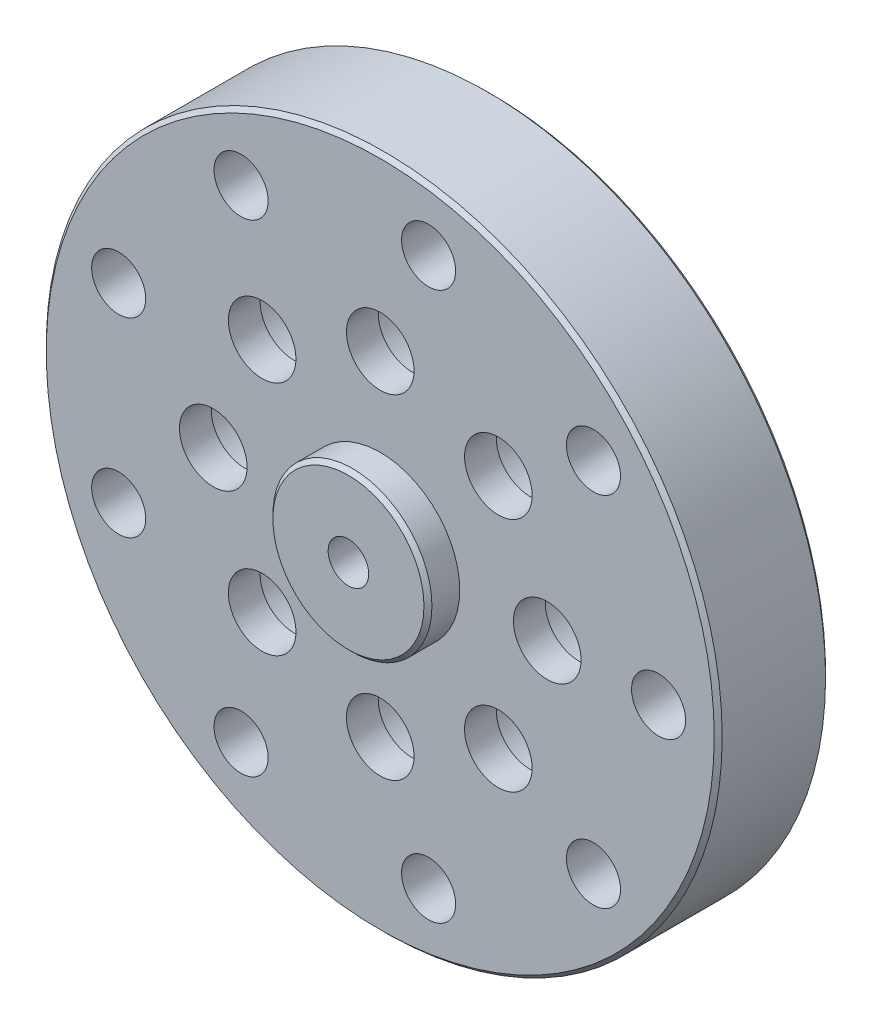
ISO-10303-21;
HEADER;
FILE_DESCRIPTION(('STEP AP214'),'2;1');
FILE_NAME('part.step','',(''),(''),'','','');
FILE_SCHEMA(('AUTOMOTIVE_DESIGN { 1 0 10303 214 1 1 1 1 }'));
ENDSEC;
DATA;
#1=APPLICATION_CONTEXT('core data for automotive mechanical design processes');
#2=APPLICATION_PROTOCOL_DEFINITION('international standard','automotive_design',2000,#1);
#3=PRODUCT_CONTEXT('',#1,'mechanical');
#4=PRODUCT('Part','Part','',(#3));
#5=PRODUCT_RELATED_PRODUCT_CATEGORY('part','',(#4));
#6=PRODUCT_DEFINITION_FORMATION('','',#4);
#7=PRODUCT_DEFINITION_CONTEXT('part definition',#1,'design');
#8=PRODUCT_DEFINITION('design','',#6,#7);
#9=PRODUCT_DEFINITION_SHAPE('','',#8);
#10=(LENGTH_UNIT() NAMED_UNIT(*) SI_UNIT(.MILLI.,.METRE.));
#11=(NAMED_UNIT(*) PLANE_ANGLE_UNIT() SI_UNIT($,.RADIAN.));
#12=(NAMED_UNIT(*) SI_UNIT($,.STERADIAN.) SOLID_ANGLE_UNIT());
#13=UNCERTAINTY_MEASURE_WITH_UNIT(LENGTH_MEASURE(1.E-05),#10,'distance_accuracy_value','');
#14=(GEOMETRIC_REPRESENTATION_CONTEXT(3) GLOBAL_UNCERTAINTY_ASSIGNED_CONTEXT((#13)) GLOBAL_UNIT_ASSIGNED_CONTEXT((#10,
#11,#12)) REPRESENTATION_CONTEXT('',''));
#15=CARTESIAN_POINT('',(0.,0.,0.));
#16=DIRECTION('',(0.,0.,1.));
#17=DIRECTION('',(1.,0.,0.));
#18=AXIS2_PLACEMENT_3D('',#15,#16,#17);
#19=CARTESIAN_POINT('',(0.,0.,14.));
#20=DIRECTION('',(0.,0.,1.));
#21=DIRECTION('',(1.,0.,0.));
#22=AXIS2_PLACEMENT_3D('',#19,#20,#21);
#23=PLANE('',#22);
#24=CARTESIAN_POINT('',(21.,0.,14.));
#25=DIRECTION('',(0.,0.,1.));
#26=DIRECTION('',(1.,0.,0.));
#27=AXIS2_PLACEMENT_3D('',#24,#25,#26);
#28=CIRCLE('',#27,4.25);
#29=CARTESIAN_POINT('',(25.25,0.,14.));
#30=VERTEX_POINT('',#29);
#31=EDGE_CURVE('E19',#30,#30,#28,.T.);
#32=ORIENTED_EDGE('',*,*,#31,.F.);
#33=EDGE_LOOP('',(#32));
#34=FACE_BOUND('',#33,.T.);
#35=CARTESIAN_POINT('',(14.8492424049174,14.8492424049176,14.));
#36=DIRECTION('',(0.,0.,1.));
#37=DIRECTION('',(1.,0.,0.));
#38=AXIS2_PLACEMENT_3D('',#35,#36,#37);
#39=CIRCLE('',#38,4.25);
#40=CARTESIAN_POINT('',(19.0992424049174,14.8492424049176,14.));
#41=VERTEX_POINT('',#40);
#42=EDGE_CURVE('E78',#41,#41,#39,.T.);
#43=ORIENTED_EDGE('',*,*,#42,.F.);
#44=EDGE_LOOP('',(#43));
#45=FACE_BOUND('',#44,.T.);
#46=CARTESIAN_POINT('',(14.8492424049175,-14.8492424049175,14.));
#47=DIRECTION('',(0.,0.,1.));
#48=DIRECTION('',(1.,0.,0.));
#49=AXIS2_PLACEMENT_3D('',#46,#47,#48);
#50=CIRCLE('',#49,4.25);
#51=CARTESIAN_POINT('',(19.0992424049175,-14.8492424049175,14.));
#52=VERTEX_POINT('',#51);
#53=EDGE_CURVE('E73',#52,#52,#50,.T.);
#54=ORIENTED_EDGE('',*,*,#53,.F.);
#55=EDGE_LOOP('',(#54));
#56=FACE_BOUND('',#55,.T.);
#57=CARTESIAN_POINT('',(0.,21.,14.));
#58=DIRECTION('',(0.,0.,1.));
#59=DIRECTION('',(1.,0.,0.));
#60=AXIS2_PLACEMENT_3D('',#57,#58,#59);
#61=CIRCLE('',#60,4.25);
#62=CARTESIAN_POINT('',(4.25,21.,14.));
#63=VERTEX_POINT('',#62);
#64=EDGE_CURVE('E67',#63,#63,#61,.T.);
#65=ORIENTED_EDGE('',*,*,#64,.F.);
#66=EDGE_LOOP('',(#65));
#67=FACE_BOUND('',#66,.T.);
#68=CARTESIAN_POINT('',(0.,-21.,14.));
#69=DIRECTION('',(0.,0.,1.));
#70=DIRECTION('',(1.,0.,0.));
#71=AXIS2_PLACEMENT_3D('',#68,#69,#70);
#72=CIRCLE('',#71,4.25);
#73=CARTESIAN_POINT('',(4.25,-21.,14.));
#74=VERTEX_POINT('',#73);
#75=EDGE_CURVE('E61',#74,#74,#72,.T.);
#76=ORIENTED_EDGE('',*,*,#75,.F.);
#77=EDGE_LOOP('',(#76));
#78=FACE_BOUND('',#77,.T.);
#79=CARTESIAN_POINT('',(-14.8492424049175,14.8492424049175,14.));
#80=DIRECTION('',(0.,0.,1.));
#81=DIRECTION('',(1.,0.,0.));
#82=AXIS2_PLACEMENT_3D('',#79,#80,#81);
#83=CIRCLE('',#82,4.25);
#84=CARTESIAN_POINT('',(-10.5992424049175,14.8492424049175,14.));
#85=VERTEX_POINT('',#84);
#86=EDGE_CURVE('E55',#85,#85,#83,.T.);
#87=ORIENTED_EDGE('',*,*,#86,.F.);
#88=EDGE_LOOP('',(#87));
#89=FACE_BOUND('',#88,.T.);
#90=CARTESIAN_POINT('',(-14.8492424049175,-14.8492424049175,14.));
#91=DIRECTION('',(0.,0.,1.));
#92=DIRECTION('',(1.,0.,0.));
#93=AXIS2_PLACEMENT_3D('',#90,#91,#92);
#94=CIRCLE('',#93,4.25);
#95=CARTESIAN_POINT('',(-10.5992424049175,-14.8492424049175,14.));
#96=VERTEX_POINT('',#95);
#97=EDGE_CURVE('E49',#96,#96,#94,.T.);
#98=ORIENTED_EDGE('',*,*,#97,.F.);
#99=EDGE_LOOP('',(#98));
#100=FACE_BOUND('',#99,.T.);
#101=CARTESIAN_POINT('',(-21.,0.,14.));
#102=DIRECTION('',(0.,0.,1.));
#103=DIRECTION('',(1.,0.,0.));
#104=AXIS2_PLACEMENT_3D('',#101,#102,#103);
#105=CIRCLE('',#104,4.25);
#106=CARTESIAN_POINT('',(-16.75,0.,14.));
#107=VERTEX_POINT('',#106);
#108=EDGE_CURVE('E44',#107,#107,#105,.T.);
#109=ORIENTED_EDGE('',*,*,#108,.F.);
#110=EDGE_LOOP('',(#109));
#111=FACE_BOUND('',#110,.T.);
#112=CARTESIAN_POINT('',(0.,0.,14.));
#113=DIRECTION('',(0.,0.,1.));
#114=DIRECTION('',(1.,0.,0.));
#115=AXIS2_PLACEMENT_3D('',#112,#113,#114);
#116=CIRCLE('',#115,42.);
#117=CARTESIAN_POINT('',(42.,0.,14.));
#118=VERTEX_POINT('',#117);
#119=EDGE_CURVE('E10',#118,#118,#116,.T.);
#120=ORIENTED_EDGE('',*,*,#119,.T.);
#121=EDGE_LOOP('',(#120));
#122=FACE_BOUND('',#121,.T.);
#123=CARTESIAN_POINT('',(34.9999999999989,0.,14.));
#124=DIRECTION('',(0.,0.,1.));
#125=DIRECTION('',(1.,0.,0.));
#126=AXIS2_PLACEMENT_3D('',#123,#124,#125);
#127=CIRCLE('',#126,3.4);
#128=CARTESIAN_POINT('',(38.3999999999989,0.,14.));
#129=VERTEX_POINT('',#128);
#130=EDGE_CURVE('E168',#129,#129,#127,.T.);
#131=ORIENTED_EDGE('',*,*,#130,.F.);
#132=EDGE_LOOP('',(#131));
#133=FACE_BOUND('',#132,.T.);
#134=CARTESIAN_POINT('',(26.8115555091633,22.4975663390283,14.));
#135=DIRECTION('',(0.,0.,1.));
#136=DIRECTION('',(1.,0.,0.));
#137=AXIS2_PLACEMENT_3D('',#134,#135,#136);
#138=CIRCLE('',#137,3.4);
#139=CARTESIAN_POINT('',(30.2115555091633,22.4975663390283,14.));
#140=VERTEX_POINT('',#139);
#141=EDGE_CURVE('E176',#140,#140,#138,.T.);
#142=ORIENTED_EDGE('',*,*,#141,.F.);
#143=EDGE_LOOP('',(#142));
#144=FACE_BOUND('',#143,.T.);
#145=CARTESIAN_POINT('',(26.8115555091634,-22.4975663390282,14.));
#146=DIRECTION('',(0.,0.,1.));
#147=DIRECTION('',(1.,0.,0.));
#148=AXIS2_PLACEMENT_3D('',#145,#146,#147);
#149=CIRCLE('',#148,3.4);
#150=CARTESIAN_POINT('',(30.2115555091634,-22.4975663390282,14.));
#151=VERTEX_POINT('',#150);
#152=EDGE_CURVE('E184',#151,#151,#149,.T.);
#153=ORIENTED_EDGE('',*,*,#152,.F.);
#154=EDGE_LOOP('',(#153));
#155=FACE_BOUND('',#154,.T.);
#156=CARTESIAN_POINT('',(6.07768621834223,34.4682713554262,14.));
#157=DIRECTION('',(0.,0.,1.));
#158=DIRECTION('',(1.,0.,0.));
#159=AXIS2_PLACEMENT_3D('',#156,#157,#158);
#160=CIRCLE('',#159,3.4);
#161=CARTESIAN_POINT('',(9.47768621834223,34.4682713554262,14.));
#162=VERTEX_POINT('',#161);
#163=EDGE_CURVE('E192',#162,#162,#160,.T.);
#164=ORIENTED_EDGE('',*,*,#163,.F.);
#165=EDGE_LOOP('',(#164));
#166=FACE_BOUND('',#165,.T.);
#167=CARTESIAN_POINT('',(6.07768621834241,-34.4682713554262,14.));
#168=DIRECTION('',(0.,0.,1.));
#169=DIRECTION('',(1.,0.,0.));
#170=AXIS2_PLACEMENT_3D('',#167,#168,#169);
#171=CIRCLE('',#170,3.4);
#172=CARTESIAN_POINT('',(9.47768621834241,-34.4682713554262,14.));
#173=VERTEX_POINT('',#172);
#174=EDGE_CURVE('E200',#173,#173,#171,.T.);
#175=ORIENTED_EDGE('',*,*,#174,.F.);
#176=EDGE_LOOP('',(#175));
#177=FACE_BOUND('',#176,.T.);
#178=CARTESIAN_POINT('',(-17.4999999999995,30.3108891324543,14.));
#179=DIRECTION('',(0.,0.,1.));
#180=DIRECTION('',(1.,0.,0.));
#181=AXIS2_PLACEMENT_3D('',#178,#179,#180);
#182=CIRCLE('',#181,3.4);
#183=CARTESIAN_POINT('',(-14.0999999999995,30.3108891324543,14.));
#184=VERTEX_POINT('',#183);
#185=EDGE_CURVE('E208',#184,#184,#182,.T.);
#186=ORIENTED_EDGE('',*,*,#185,.F.);
#187=EDGE_LOOP('',(#186));
#188=FACE_BOUND('',#187,.T.);
#189=CARTESIAN_POINT('',(-17.4999999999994,-30.3108891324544,14.));
#190=DIRECTION('',(0.,0.,1.));
#191=DIRECTION('',(1.,0.,0.));
#192=AXIS2_PLACEMENT_3D('',#189,#190,#191);
#193=CIRCLE('',#192,3.4);
#194=CARTESIAN_POINT('',(-14.0999999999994,-30.3108891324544,14.));
#195=VERTEX_POINT('',#194);
#196=EDGE_CURVE('E216',#195,#195,#193,.T.);
#197=ORIENTED_EDGE('',*,*,#196,.F.);
#198=EDGE_LOOP('',(#197));
#199=FACE_BOUND('',#198,.T.);
#200=CARTESIAN_POINT('',(-32.8892417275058,11.9707050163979,14.));
#201=DIRECTION('',(0.,0.,1.));
#202=DIRECTION('',(1.,0.,0.));
#203=AXIS2_PLACEMENT_3D('',#200,#201,#202);
#204=CIRCLE('',#203,3.4);
#205=CARTESIAN_POINT('',(-29.4892417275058,11.9707050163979,14.));
#206=VERTEX_POINT('',#205);
#207=EDGE_CURVE('E224',#206,#206,#204,.T.);
#208=ORIENTED_EDGE('',*,*,#207,.F.);
#209=EDGE_LOOP('',(#208));
#210=FACE_BOUND('',#209,.T.);
#211=CARTESIAN_POINT('',(-32.8892417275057,-11.9707050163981,14.));
#212=DIRECTION('',(0.,0.,1.));
#213=DIRECTION('',(1.,0.,0.));
#214=AXIS2_PLACEMENT_3D('',#211,#212,#213);
#215=CIRCLE('',#214,3.4);
#216=CARTESIAN_POINT('',(-29.4892417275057,-11.9707050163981,14.));
#217=VERTEX_POINT('',#216);
#218=EDGE_CURVE('E232',#217,#217,#215,.T.);
#219=ORIENTED_EDGE('',*,*,#218,.F.);
#220=EDGE_LOOP('',(#219));
#221=FACE_BOUND('',#220,.T.);
#222=CARTESIAN_POINT('',(0.,0.,14.));
#223=DIRECTION('',(0.,0.,1.));
#224=DIRECTION('',(1.,0.,0.));
#225=AXIS2_PLACEMENT_3D('',#222,#223,#224);
#226=CIRCLE('',#225,10.);
#227=CARTESIAN_POINT('',(10.,0.,14.));
#228=VERTEX_POINT('',#227);
#229=EDGE_CURVE('E237',#228,#228,#226,.T.);
#230=ORIENTED_EDGE('',*,*,#229,.F.);
#231=EDGE_LOOP('',(#230));
#232=FACE_BOUND('',#231,.T.);
#233=ADVANCED_FACE('F15',(#34,#45,#56,#67,#78,#89,#100,#111,#122,#133,#144,#155,#166,#177,#188,
#199,#210,#221,#232),#23,.T.);
#234=CARTESIAN_POINT('',(0.,0.,0.));
#235=DIRECTION('',(0.,0.,-1.));
#236=DIRECTION('',(-1.,0.,0.));
#237=AXIS2_PLACEMENT_3D('',#234,#235,#236);
#238=PLANE('',#237);
#239=CARTESIAN_POINT('',(21.,0.,0.));
#240=DIRECTION('',(0.,0.,1.));
#241=DIRECTION('',(1.,0.,0.));
#242=AXIS2_PLACEMENT_3D('',#239,#240,#241);
#243=CIRCLE('',#242,7.);
#244=CARTESIAN_POINT('',(28.,0.,0.));
#245=VERTEX_POINT('',#244);
#246=EDGE_CURVE('E1032',#245,#245,#243,.T.);
#247=ORIENTED_EDGE('',*,*,#246,.T.);
#248=EDGE_LOOP('',(#247));
#249=FACE_BOUND('',#248,.T.);
#250=CARTESIAN_POINT('',(14.8492424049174,14.8492424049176,0.));
#251=DIRECTION('',(0.,0.,1.));
#252=DIRECTION('',(1.,0.,0.));
#253=AXIS2_PLACEMENT_3D('',#250,#251,#252);
#254=CIRCLE('',#253,7.);
#255=CARTESIAN_POINT('',(21.8492424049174,14.8492424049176,0.));
#256=VERTEX_POINT('',#255);
#257=EDGE_CURVE('E102',#256,#256,#254,.T.);
#258=ORIENTED_EDGE('',*,*,#257,.T.);
#259=EDGE_LOOP('',(#258));
#260=FACE_BOUND('',#259,.T.);
#261=CARTESIAN_POINT('',(14.8492424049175,-14.8492424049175,0.));
#262=DIRECTION('',(0.,0.,1.));
#263=DIRECTION('',(1.,0.,0.));
#264=AXIS2_PLACEMENT_3D('',#261,#262,#263);
#265=CIRCLE('',#264,7.);
#266=CARTESIAN_POINT('',(21.8492424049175,-14.8492424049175,0.));
#267=VERTEX_POINT('',#266);
#268=EDGE_CURVE('E81',#267,#267,#265,.T.);
#269=ORIENTED_EDGE('',*,*,#268,.T.);
#270=EDGE_LOOP('',(#269));
#271=FACE_BOUND('',#270,.T.);
#272=CARTESIAN_POINT('',(0.,21.,0.));
#273=DIRECTION('',(0.,0.,1.));
#274=DIRECTION('',(1.,0.,0.));
#275=AXIS2_PLACEMENT_3D('',#272,#273,#274);
#276=CIRCLE('',#275,7.);
#277=CARTESIAN_POINT('',(7.,21.,0.));
#278=VERTEX_POINT('',#277);
#279=EDGE_CURVE('E76',#278,#278,#276,.T.);
#280=ORIENTED_EDGE('',*,*,#279,.T.);
#281=EDGE_LOOP('',(#280));
#282=FACE_BOUND('',#281,.T.);
#283=CARTESIAN_POINT('',(0.,-21.,0.));
#284=DIRECTION('',(0.,0.,1.));
#285=DIRECTION('',(1.,0.,0.));
#286=AXIS2_PLACEMENT_3D('',#283,#284,#285);
#287=CIRCLE('',#286,7.);
#288=CARTESIAN_POINT('',(7.,-21.,0.));
#289=VERTEX_POINT('',#288);
#290=EDGE_CURVE('E71',#289,#289,#287,.T.);
#291=ORIENTED_EDGE('',*,*,#290,.T.);
#292=EDGE_LOOP('',(#291));
#293=FACE_BOUND('',#292,.T.);
#294=CARTESIAN_POINT('',(-14.8492424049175,14.8492424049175,0.));
#295=DIRECTION('',(0.,0.,1.));
#296=DIRECTION('',(1.,0.,0.));
#297=AXIS2_PLACEMENT_3D('',#294,#295,#296);
#298=CIRCLE('',#297,7.);
#299=CARTESIAN_POINT('',(-7.8492424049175,14.8492424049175,0.));
#300=VERTEX_POINT('',#299);
#301=EDGE_CURVE('E65',#300,#300,#298,.T.);
#302=ORIENTED_EDGE('',*,*,#301,.T.);
#303=EDGE_LOOP('',(#302));
#304=FACE_BOUND('',#303,.T.);
#305=CARTESIAN_POINT('',(-14.8492424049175,-14.8492424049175,0.));
#306=DIRECTION('',(0.,0.,1.));
#307=DIRECTION('',(1.,0.,0.));
#308=AXIS2_PLACEMENT_3D('',#305,#306,#307);
#309=CIRCLE('',#308,7.);
#310=CARTESIAN_POINT('',(-7.8492424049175,-14.8492424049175,0.));
#311=VERTEX_POINT('',#310);
#312=EDGE_CURVE('E59',#311,#311,#309,.T.);
#313=ORIENTED_EDGE('',*,*,#312,.T.);
#314=EDGE_LOOP('',(#313));
#315=FACE_BOUND('',#314,.T.);
#316=CARTESIAN_POINT('',(-21.,0.,0.));
#317=DIRECTION('',(0.,0.,1.));
#318=DIRECTION('',(1.,0.,0.));
#319=AXIS2_PLACEMENT_3D('',#316,#317,#318);
#320=CIRCLE('',#319,7.);
#321=CARTESIAN_POINT('',(-14.,0.,0.));
#322=VERTEX_POINT('',#321);
#323=EDGE_CURVE('E53',#322,#322,#320,.T.);
#324=ORIENTED_EDGE('',*,*,#323,.T.);
#325=EDGE_LOOP('',(#324));
#326=FACE_BOUND('',#325,.T.);
#327=CARTESIAN_POINT('',(0.,0.,0.));
#328=DIRECTION('',(0.,0.,-1.));
#329=DIRECTION('',(-1.,0.,0.));
#330=AXIS2_PLACEMENT_3D('',#327,#328,#329);
#331=CIRCLE('',#330,10.5);
#332=CARTESIAN_POINT('',(-10.5,0.,0.));
#333=VERTEX_POINT('',#332);
#334=EDGE_CURVE('E255',#333,#333,#331,.F.);
#335=ORIENTED_EDGE('',*,*,#334,.T.);
#336=EDGE_LOOP('',(#335));
#337=FACE_BOUND('',#336,.T.);
#338=CARTESIAN_POINT('',(0.,0.,0.));
#339=DIRECTION('',(0.,0.,-1.));
#340=DIRECTION('',(-1.,0.,0.));
#341=AXIS2_PLACEMENT_3D('',#338,#339,#340);
#342=CIRCLE('',#341,42.);
#343=CARTESIAN_POINT('',(-42.,0.,0.));
#344=VERTEX_POINT('',#343);
#345=EDGE_CURVE('E251',#344,#344,#342,.T.);
#346=ORIENTED_EDGE('',*,*,#345,.T.);
#347=EDGE_LOOP('',(#346));
#348=FACE_BOUND('',#347,.T.);
#349=CARTESIAN_POINT('',(34.9999999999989,0.,0.));
#350=DIRECTION('',(0.,0.,1.));
#351=DIRECTION('',(1.,0.,0.));
#352=AXIS2_PLACEMENT_3D('',#349,#350,#351);
#353=CIRCLE('',#352,3.4);
#354=CARTESIAN_POINT('',(38.3999999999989,0.,0.));
#355=VERTEX_POINT('',#354);
#356=EDGE_CURVE('E42',#355,#355,#353,.T.);
#357=ORIENTED_EDGE('',*,*,#356,.T.);
#358=EDGE_LOOP('',(#357));
#359=FACE_BOUND('',#358,.T.);
#360=CARTESIAN_POINT('',(26.8115555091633,22.4975663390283,0.));
#361=DIRECTION('',(0.,0.,1.));
#362=DIRECTION('',(1.,0.,0.));
#363=AXIS2_PLACEMENT_3D('',#360,#361,#362);
#364=CIRCLE('',#363,3.4);
#365=CARTESIAN_POINT('',(30.2115555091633,22.4975663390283,0.));
#366=VERTEX_POINT('',#365);
#367=EDGE_CURVE('E172',#366,#366,#364,.T.);
#368=ORIENTED_EDGE('',*,*,#367,.T.);
#369=EDGE_LOOP('',(#368));
#370=FACE_BOUND('',#369,.T.);
#371=CARTESIAN_POINT('',(26.8115555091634,-22.4975663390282,0.));
#372=DIRECTION('',(0.,0.,1.));
#373=DIRECTION('',(1.,0.,0.));
#374=AXIS2_PLACEMENT_3D('',#371,#372,#373);
#375=CIRCLE('',#374,3.4);
#376=CARTESIAN_POINT('',(30.2115555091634,-22.4975663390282,0.));
#377=VERTEX_POINT('',#376);
#378=EDGE_CURVE('E180',#377,#377,#375,.T.);
#379=ORIENTED_EDGE('',*,*,#378,.T.);
#380=EDGE_LOOP('',(#379));
#381=FACE_BOUND('',#380,.T.);
#382=CARTESIAN_POINT('',(6.07768621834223,34.4682713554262,0.));
#383=DIRECTION('',(0.,0.,1.));
#384=DIRECTION('',(1.,0.,0.));
#385=AXIS2_PLACEMENT_3D('',#382,#383,#384);
#386=CIRCLE('',#385,3.4);
#387=CARTESIAN_POINT('',(9.47768621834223,34.4682713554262,0.));
#388=VERTEX_POINT('',#387);
#389=EDGE_CURVE('E188',#388,#388,#386,.T.);
#390=ORIENTED_EDGE('',*,*,#389,.T.);
#391=EDGE_LOOP('',(#390));
#392=FACE_BOUND('',#391,.T.);
#393=CARTESIAN_POINT('',(6.07768621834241,-34.4682713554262,0.));
#394=DIRECTION('',(0.,0.,1.));
#395=DIRECTION('',(1.,0.,0.));
#396=AXIS2_PLACEMENT_3D('',#393,#394,#395);
#397=CIRCLE('',#396,3.4);
#398=CARTESIAN_POINT('',(9.47768621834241,-34.4682713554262,0.));
#399=VERTEX_POINT('',#398);
#400=EDGE_CURVE('E196',#399,#399,#397,.T.);
#401=ORIENTED_EDGE('',*,*,#400,.T.);
#402=EDGE_LOOP('',(#401));
#403=FACE_BOUND('',#402,.T.);
#404=CARTESIAN_POINT('',(-17.4999999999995,30.3108891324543,0.));
#405=DIRECTION('',(0.,0.,1.));
#406=DIRECTION('',(1.,0.,0.));
#407=AXIS2_PLACEMENT_3D('',#404,#405,#406);
#408=CIRCLE('',#407,3.4);
#409=CARTESIAN_POINT('',(-14.0999999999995,30.3108891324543,0.));
#410=VERTEX_POINT('',#409);
#411=EDGE_CURVE('E204',#410,#410,#408,.T.);
#412=ORIENTED_EDGE('',*,*,#411,.T.);
#413=EDGE_LOOP('',(#412));
#414=FACE_BOUND('',#413,.T.);
#415=CARTESIAN_POINT('',(-17.4999999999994,-30.3108891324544,0.));
#416=DIRECTION('',(0.,0.,1.));
#417=DIRECTION('',(1.,0.,0.));
#418=AXIS2_PLACEMENT_3D('',#415,#416,#417);
#419=CIRCLE('',#418,3.4);
#420=CARTESIAN_POINT('',(-14.0999999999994,-30.3108891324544,0.));
#421=VERTEX_POINT('',#420);
#422=EDGE_CURVE('E212',#421,#421,#419,.T.);
#423=ORIENTED_EDGE('',*,*,#422,.T.);
#424=EDGE_LOOP('',(#423));
#425=FACE_BOUND('',#424,.T.);
#426=CARTESIAN_POINT('',(-32.8892417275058,11.9707050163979,0.));
#427=DIRECTION('',(0.,0.,1.));
#428=DIRECTION('',(1.,0.,0.));
#429=AXIS2_PLACEMENT_3D('',#426,#427,#428);
#430=CIRCLE('',#429,3.4);
#431=CARTESIAN_POINT('',(-29.4892417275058,11.9707050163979,0.));
#432=VERTEX_POINT('',#431);
#433=EDGE_CURVE('E220',#432,#432,#430,.T.);
#434=ORIENTED_EDGE('',*,*,#433,.T.);
#435=EDGE_LOOP('',(#434));
#436=FACE_BOUND('',#435,.T.);
#437=CARTESIAN_POINT('',(-32.8892417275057,-11.9707050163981,0.));
#438=DIRECTION('',(0.,0.,1.));
#439=DIRECTION('',(1.,0.,0.));
#440=AXIS2_PLACEMENT_3D('',#437,#438,#439);
#441=CIRCLE('',#440,3.4);
#442=CARTESIAN_POINT('',(-29.4892417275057,-11.9707050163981,0.));
#443=VERTEX_POINT('',#442);
#444=EDGE_CURVE('E228',#443,#443,#441,.T.);
#445=ORIENTED_EDGE('',*,*,#444,.T.);
#446=EDGE_LOOP('',(#445));
#447=FACE_BOUND('',#446,.T.);
#448=ADVANCED_FACE('F285',(#249,#260,#271,#282,#293,#304,#315,#326,#337,#348,#359,#370,#381,
#392,#403,#414,#425,#436,#447),#238,.T.);
#449=CARTESIAN_POINT('',(0.,0.,0.));
#450=DIRECTION('',(0.,0.,1.));
#451=DIRECTION('',(1.,0.,0.));
#452=AXIS2_PLACEMENT_3D('',#449,#450,#451);
#453=CYLINDRICAL_SURFACE('',#452,42.5);
#454=CARTESIAN_POINT('',(0.,0.,13.5));
#455=DIRECTION('',(0.,0.,1.));
#456=DIRECTION('',(1.,0.,0.));
#457=AXIS2_PLACEMENT_3D('',#454,#455,#456);
#458=CIRCLE('',#457,42.5);
#459=CARTESIAN_POINT('',(42.5,0.,13.5));
#460=VERTEX_POINT('',#459);
#461=EDGE_CURVE('E24',#460,#460,#458,.F.);
#462=ORIENTED_EDGE('',*,*,#461,.T.);
#463=EDGE_LOOP('',(#462));
#464=FACE_BOUND('',#463,.T.);
#465=CARTESIAN_POINT('',(0.,0.,0.5));
#466=DIRECTION('',(0.,0.,-1.));
#467=DIRECTION('',(-1.,0.,0.));
#468=AXIS2_PLACEMENT_3D('',#465,#466,#467);
#469=CIRCLE('',#468,42.5);
#470=CARTESIAN_POINT('',(-42.5,0.,0.5));
#471=VERTEX_POINT('',#470);
#472=EDGE_CURVE('E34',#471,#471,#469,.F.);
#473=ORIENTED_EDGE('',*,*,#472,.T.);
#474=EDGE_LOOP('',(#473));
#475=FACE_BOUND('',#474,.T.);
#476=ADVANCED_FACE('F267',(#464,#475),#453,.T.);
#477=CARTESIAN_POINT('',(0.,0.,4.));
#478=DIRECTION('',(0.,0.,1.));
#479=DIRECTION('',(1.,0.,0.));
#480=AXIS2_PLACEMENT_3D('',#477,#478,#479);
#481=PLANE('',#480);
#482=CARTESIAN_POINT('',(0.,0.,4.));
#483=DIRECTION('',(0.,0.,1.));
#484=DIRECTION('',(1.,0.,0.));
#485=AXIS2_PLACEMENT_3D('',#482,#483,#484);
#486=CIRCLE('',#485,2.55);
#487=CARTESIAN_POINT('',(2.55,0.,4.));
#488=VERTEX_POINT('',#487);
#489=EDGE_CURVE('E43',#488,#488,#486,.T.);
#490=ORIENTED_EDGE('',*,*,#489,.T.);
#491=EDGE_LOOP('',(#490));
#492=FACE_BOUND('',#491,.T.);
#493=CARTESIAN_POINT('',(0.,0.,4.));
#494=DIRECTION('',(0.,0.,-1.));
#495=DIRECTION('',(1.,0.,0.));
#496=AXIS2_PLACEMENT_3D('',#493,#494,#495);
#497=CIRCLE('',#496,10.);
#498=CARTESIAN_POINT('',(10.,0.,4.));
#499=VERTEX_POINT('',#498);
#500=EDGE_CURVE('E236',#499,#499,#497,.F.);
#501=ORIENTED_EDGE('',*,*,#500,.F.);
#502=EDGE_LOOP('',(#501));
#503=FACE_BOUND('',#502,.T.);
#504=ADVANCED_FACE('F299',(#492,#503),#481,.F.);
#505=CARTESIAN_POINT('',(0.,0.,0.));
#506=DIRECTION('',(0.,0.,1.));
#507=DIRECTION('',(1.,0.,0.));
#508=AXIS2_PLACEMENT_3D('',#505,#506,#507);
#509=CYLINDRICAL_SURFACE('',#508,10.);
#510=CARTESIAN_POINT('',(0.,0.,0.5));
#511=DIRECTION('',(0.,0.,-1.));
#512=DIRECTION('',(-1.,0.,0.));
#513=AXIS2_PLACEMENT_3D('',#510,#511,#512);
#514=CIRCLE('',#513,10.);
#515=CARTESIAN_POINT('',(-10.,0.,0.5));
#516=VERTEX_POINT('',#515);
#517=EDGE_CURVE('E258',#516,#516,#514,.T.);
#518=ORIENTED_EDGE('',*,*,#517,.T.);
#519=EDGE_LOOP('',(#518));
#520=FACE_BOUND('',#519,.T.);
#521=ORIENTED_EDGE('',*,*,#500,.T.);
#522=EDGE_LOOP('',(#521));
#523=FACE_BOUND('',#522,.T.);
#524=ADVANCED_FACE('F353',(#520,#523),#509,.F.);
#525=CARTESIAN_POINT('',(0.,0.,18.));
#526=DIRECTION('',(0.,0.,1.));
#527=DIRECTION('',(1.,0.,0.));
#528=AXIS2_PLACEMENT_3D('',#525,#526,#527);
#529=PLANE('',#528);
#530=CARTESIAN_POINT('',(0.,0.,18.));
#531=DIRECTION('',(0.,0.,1.));
#532=DIRECTION('',(1.,0.,0.));
#533=AXIS2_PLACEMENT_3D('',#530,#531,#532);
#534=CIRCLE('',#533,2.55);
#535=CARTESIAN_POINT('',(2.55,0.,18.));
#536=VERTEX_POINT('',#535);
#537=EDGE_CURVE('E38',#536,#536,#534,.T.);
#538=ORIENTED_EDGE('',*,*,#537,.F.);
#539=EDGE_LOOP('',(#538));
#540=FACE_BOUND('',#539,.T.);
#541=CARTESIAN_POINT('',(0.,0.,18.));
#542=DIRECTION('',(0.,0.,1.));
#543=DIRECTION('',(1.,0.,0.));
#544=AXIS2_PLACEMENT_3D('',#541,#542,#543);
#545=CIRCLE('',#544,9.5);
#546=CARTESIAN_POINT('',(9.5,0.,18.));
#547=VERTEX_POINT('',#546);
#548=EDGE_CURVE('E248',#547,#547,#545,.T.);
#549=ORIENTED_EDGE('',*,*,#548,.T.);
#550=EDGE_LOOP('',(#549));
#551=FACE_BOUND('',#550,.T.);
#552=ADVANCED_FACE('F347',(#540,#551),#529,.T.);
#553=CARTESIAN_POINT('',(0.,0.,14.));
#554=DIRECTION('',(0.,0.,1.));
#555=DIRECTION('',(1.,0.,0.));
#556=AXIS2_PLACEMENT_3D('',#553,#554,#555);
#557=CYLINDRICAL_SURFACE('',#556,10.);
#558=CARTESIAN_POINT('',(0.,0.,17.5));
#559=DIRECTION('',(0.,0.,1.));
#560=DIRECTION('',(1.,0.,0.));
#561=AXIS2_PLACEMENT_3D('',#558,#559,#560);
#562=CIRCLE('',#561,10.);
#563=CARTESIAN_POINT('',(10.,0.,17.5));
#564=VERTEX_POINT('',#563);
#565=EDGE_CURVE('E241',#564,#564,#562,.F.);
#566=ORIENTED_EDGE('',*,*,#565,.T.);
#567=EDGE_LOOP('',(#566));
#568=FACE_BOUND('',#567,.T.);
#569=ORIENTED_EDGE('',*,*,#229,.T.);
#570=EDGE_LOOP('',(#569));
#571=FACE_BOUND('',#570,.T.);
#572=ADVANCED_FACE('F337',(#568,#571),#557,.T.);
#573=CARTESIAN_POINT('',(-32.8892417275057,-11.9707050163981,0.));
#574=DIRECTION('',(0.,0.,1.));
#575=DIRECTION('',(1.,0.,0.));
#576=AXIS2_PLACEMENT_3D('',#573,#574,#575);
#577=CYLINDRICAL_SURFACE('',#576,3.4);
#578=ORIENTED_EDGE('',*,*,#218,.T.);
#579=EDGE_LOOP('',(#578));
#580=FACE_BOUND('',#579,.T.);
#581=ORIENTED_EDGE('',*,*,#444,.F.);
#582=EDGE_LOOP('',(#581));
#583=FACE_BOUND('',#582,.T.);
#584=ADVANCED_FACE('F334',(#580,#583),#577,.F.);
#585=CARTESIAN_POINT('',(-32.8892417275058,11.9707050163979,0.));
#586=DIRECTION('',(0.,0.,1.));
#587=DIRECTION('',(1.,0.,0.));
#588=AXIS2_PLACEMENT_3D('',#585,#586,#587);
#589=CYLINDRICAL_SURFACE('',#588,3.4);
#590=ORIENTED_EDGE('',*,*,#207,.T.);
#591=EDGE_LOOP('',(#590));
#592=FACE_BOUND('',#591,.T.);
#593=ORIENTED_EDGE('',*,*,#433,.F.);
#594=EDGE_LOOP('',(#593));
#595=FACE_BOUND('',#594,.T.);
#596=ADVANCED_FACE('F336',(#592,#595),#589,.F.);
#597=CARTESIAN_POINT('',(-17.4999999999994,-30.3108891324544,0.));
#598=DIRECTION('',(0.,0.,1.));
#599=DIRECTION('',(1.,0.,0.));
#600=AXIS2_PLACEMENT_3D('',#597,#598,#599);
#601=CYLINDRICAL_SURFACE('',#600,3.4);
#602=ORIENTED_EDGE('',*,*,#196,.T.);
#603=EDGE_LOOP('',(#602));
#604=FACE_BOUND('',#603,.T.);
#605=ORIENTED_EDGE('',*,*,#422,.F.);
#606=EDGE_LOOP('',(#605));
#607=FACE_BOUND('',#606,.T.);
#608=ADVANCED_FACE('F344',(#604,#607),#601,.F.);
#609=CARTESIAN_POINT('',(-17.4999999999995,30.3108891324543,0.));
#610=DIRECTION('',(0.,0.,1.));
#611=DIRECTION('',(1.,0.,0.));
#612=AXIS2_PLACEMENT_3D('',#609,#610,#611);
#613=CYLINDRICAL_SURFACE('',#612,3.4);
#614=ORIENTED_EDGE('',*,*,#185,.T.);
#615=EDGE_LOOP('',(#614));
#616=FACE_BOUND('',#615,.T.);
#617=ORIENTED_EDGE('',*,*,#411,.F.);
#618=EDGE_LOOP('',(#617));
#619=FACE_BOUND('',#618,.T.);
#620=ADVANCED_FACE('F402',(#616,#619),#613,.F.);
#621=CARTESIAN_POINT('',(6.07768621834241,-34.4682713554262,0.));
#622=DIRECTION('',(0.,0.,1.));
#623=DIRECTION('',(1.,0.,0.));
#624=AXIS2_PLACEMENT_3D('',#621,#622,#623);
#625=CYLINDRICAL_SURFACE('',#624,3.4);
#626=ORIENTED_EDGE('',*,*,#174,.T.);
#627=EDGE_LOOP('',(#626));
#628=FACE_BOUND('',#627,.T.);
#629=ORIENTED_EDGE('',*,*,#400,.F.);
#630=EDGE_LOOP('',(#629));
#631=FACE_BOUND('',#630,.T.);
#632=ADVANCED_FACE('F412',(#628,#631),#625,.F.);
#633=CARTESIAN_POINT('',(6.07768621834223,34.4682713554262,0.));
#634=DIRECTION('',(0.,0.,1.));
#635=DIRECTION('',(1.,0.,0.));
#636=AXIS2_PLACEMENT_3D('',#633,#634,#635);
#637=CYLINDRICAL_SURFACE('',#636,3.4);
#638=ORIENTED_EDGE('',*,*,#163,.T.);
#639=EDGE_LOOP('',(#638));
#640=FACE_BOUND('',#639,.T.);
#641=ORIENTED_EDGE('',*,*,#389,.F.);
#642=EDGE_LOOP('',(#641));
#643=FACE_BOUND('',#642,.T.);
#644=ADVANCED_FACE('F423',(#640,#643),#637,.F.);
#645=CARTESIAN_POINT('',(26.8115555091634,-22.4975663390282,0.));
#646=DIRECTION('',(0.,0.,1.));
#647=DIRECTION('',(1.,0.,0.));
#648=AXIS2_PLACEMENT_3D('',#645,#646,#647);
#649=CYLINDRICAL_SURFACE('',#648,3.4);
#650=ORIENTED_EDGE('',*,*,#152,.T.);
#651=EDGE_LOOP('',(#650));
#652=FACE_BOUND('',#651,.T.);
#653=ORIENTED_EDGE('',*,*,#378,.F.);
#654=EDGE_LOOP('',(#653));
#655=FACE_BOUND('',#654,.T.);
#656=ADVANCED_FACE('F434',(#652,#655),#649,.F.);
#657=CARTESIAN_POINT('',(26.8115555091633,22.4975663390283,0.));
#658=DIRECTION('',(0.,0.,1.));
#659=DIRECTION('',(1.,0.,0.));
#660=AXIS2_PLACEMENT_3D('',#657,#658,#659);
#661=CYLINDRICAL_SURFACE('',#660,3.4);
#662=ORIENTED_EDGE('',*,*,#141,.T.);
#663=EDGE_LOOP('',(#662));
#664=FACE_BOUND('',#663,.T.);
#665=ORIENTED_EDGE('',*,*,#367,.F.);
#666=EDGE_LOOP('',(#665));
#667=FACE_BOUND('',#666,.T.);
#668=ADVANCED_FACE('F445',(#664,#667),#661,.F.);
#669=CARTESIAN_POINT('',(34.9999999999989,0.,0.));
#670=DIRECTION('',(0.,0.,1.));
#671=DIRECTION('',(1.,0.,0.));
#672=AXIS2_PLACEMENT_3D('',#669,#670,#671);
#673=CYLINDRICAL_SURFACE('',#672,3.4);
#674=ORIENTED_EDGE('',*,*,#130,.T.);
#675=EDGE_LOOP('',(#674));
#676=FACE_BOUND('',#675,.T.);
#677=ORIENTED_EDGE('',*,*,#356,.F.);
#678=EDGE_LOOP('',(#677));
#679=FACE_BOUND('',#678,.T.);
#680=ADVANCED_FACE('F304',(#676,#679),#673,.F.);
#681=CARTESIAN_POINT('',(0.,0.,17.5));
#682=DIRECTION('',(0.,0.,-1.));
#683=DIRECTION('',(-1.,0.,0.));
#684=AXIS2_PLACEMENT_3D('',#681,#682,#683);
#685=CONICAL_SURFACE('',#684,10.,0.785398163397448);
#686=ORIENTED_EDGE('',*,*,#548,.F.);
#687=EDGE_LOOP('',(#686));
#688=FACE_BOUND('',#687,.T.);
#689=ORIENTED_EDGE('',*,*,#565,.F.);
#690=EDGE_LOOP('',(#689));
#691=FACE_BOUND('',#690,.T.);
#692=ADVANCED_FACE('F301',(#688,#691),#685,.T.);
#693=CARTESIAN_POINT('',(0.,0.,0.));
#694=DIRECTION('',(0.,0.,-1.));
#695=DIRECTION('',(-1.,0.,0.));
#696=AXIS2_PLACEMENT_3D('',#693,#694,#695);
#697=CONICAL_SURFACE('',#696,10.5,0.785398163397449);
#698=ORIENTED_EDGE('',*,*,#517,.F.);
#699=EDGE_LOOP('',(#698));
#700=FACE_BOUND('',#699,.T.);
#701=ORIENTED_EDGE('',*,*,#334,.F.);
#702=EDGE_LOOP('',(#701));
#703=FACE_BOUND('',#702,.T.);
#704=ADVANCED_FACE('F281',(#700,#703),#697,.F.);
#705=CARTESIAN_POINT('',(0.,0.,13.5));
#706=DIRECTION('',(0.,0.,-1.));
#707=DIRECTION('',(-1.,0.,0.));
#708=AXIS2_PLACEMENT_3D('',#705,#706,#707);
#709=CONICAL_SURFACE('',#708,42.5,0.785398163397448);
#710=ORIENTED_EDGE('',*,*,#119,.F.);
#711=EDGE_LOOP('',(#710));
#712=FACE_BOUND('',#711,.T.);
#713=ORIENTED_EDGE('',*,*,#461,.F.);
#714=EDGE_LOOP('',(#713));
#715=FACE_BOUND('',#714,.T.);
#716=ADVANCED_FACE('F271',(#712,#715),#709,.T.);
#717=CARTESIAN_POINT('',(0.,0.,0.5));
#718=DIRECTION('',(0.,0.,1.));
#719=DIRECTION('',(1.,0.,0.));
#720=AXIS2_PLACEMENT_3D('',#717,#718,#719);
#721=CONICAL_SURFACE('',#720,42.5,0.785398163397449);
#722=ORIENTED_EDGE('',*,*,#345,.F.);
#723=EDGE_LOOP('',(#722));
#724=FACE_BOUND('',#723,.T.);
#725=ORIENTED_EDGE('',*,*,#472,.F.);
#726=EDGE_LOOP('',(#725));
#727=FACE_BOUND('',#726,.T.);
#728=ADVANCED_FACE('F17',(#724,#727),#721,.T.);
#729=CARTESIAN_POINT('',(0.,0.,4.));
#730=DIRECTION('',(0.,0.,1.));
#731=DIRECTION('',(1.,0.,0.));
#732=AXIS2_PLACEMENT_3D('',#729,#730,#731);
#733=CYLINDRICAL_SURFACE('',#732,2.55);
#734=ORIENTED_EDGE('',*,*,#537,.T.);
#735=EDGE_LOOP('',(#734));
#736=FACE_BOUND('',#735,.T.);
#737=ORIENTED_EDGE('',*,*,#489,.F.);
#738=EDGE_LOOP('',(#737));
#739=FACE_BOUND('',#738,.T.);
#740=ADVANCED_FACE('F270',(#736,#739),#733,.F.);
#741=CARTESIAN_POINT('',(-21.,0.,72.4675901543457));
#742=DIRECTION('',(0.,0.,1.));
#743=DIRECTION('',(1.,0.,0.));
#744=AXIS2_PLACEMENT_3D('',#741,#742,#743);
#745=CYLINDRICAL_SURFACE('',#744,4.25);
#746=ORIENTED_EDGE('',*,*,#108,.T.);
#747=EDGE_LOOP('',(#746));
#748=FACE_BOUND('',#747,.T.);
#749=CARTESIAN_POINT('',(-21.,0.,10.));
#750=DIRECTION('',(0.,0.,1.));
#751=DIRECTION('',(1.,0.,0.));
#752=AXIS2_PLACEMENT_3D('',#749,#750,#751);
#753=CIRCLE('',#752,4.25);
#754=CARTESIAN_POINT('',(-16.75,0.,10.));
#755=VERTEX_POINT('',#754);
#756=EDGE_CURVE('E48',#755,#755,#753,.F.);
#757=ORIENTED_EDGE('',*,*,#756,.T.);
#758=EDGE_LOOP('',(#757));
#759=FACE_BOUND('',#758,.T.);
#760=ADVANCED_FACE('F278',(#748,#759),#745,.F.);
#761=CARTESIAN_POINT('',(-21.,0.,10.));
#762=DIRECTION('',(0.,0.,1.));
#763=DIRECTION('',(1.,0.,0.));
#764=AXIS2_PLACEMENT_3D('',#761,#762,#763);
#765=PLANE('',#764);
#766=ORIENTED_EDGE('',*,*,#756,.F.);
#767=EDGE_LOOP('',(#766));
#768=FACE_BOUND('',#767,.T.);
#769=CARTESIAN_POINT('',(-21.,0.,10.));
#770=DIRECTION('',(0.,0.,1.));
#771=DIRECTION('',(1.,0.,0.));
#772=AXIS2_PLACEMENT_3D('',#769,#770,#771);
#773=CIRCLE('',#772,7.);
#774=CARTESIAN_POINT('',(-14.,0.,10.));
#775=VERTEX_POINT('',#774);
#776=EDGE_CURVE('E155',#775,#775,#773,.F.);
#777=ORIENTED_EDGE('',*,*,#776,.T.);
#778=EDGE_LOOP('',(#777));
#779=FACE_BOUND('',#778,.T.);
#780=ADVANCED_FACE('F507',(#768,#779),#765,.F.);
#781=CARTESIAN_POINT('',(-21.,0.,0.));
#782=DIRECTION('',(0.,0.,1.));
#783=DIRECTION('',(1.,0.,0.));
#784=AXIS2_PLACEMENT_3D('',#781,#782,#783);
#785=CYLINDRICAL_SURFACE('',#784,7.);
#786=ORIENTED_EDGE('',*,*,#776,.F.);
#787=EDGE_LOOP('',(#786));
#788=FACE_BOUND('',#787,.T.);
#789=ORIENTED_EDGE('',*,*,#323,.F.);
#790=EDGE_LOOP('',(#789));
#791=FACE_BOUND('',#790,.T.);
#792=ADVANCED_FACE('F518',(#788,#791),#785,.F.);
#793=CARTESIAN_POINT('',(-14.8492424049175,-14.8492424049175,72.4675901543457));
#794=DIRECTION('',(0.,0.,1.));
#795=DIRECTION('',(1.,0.,0.));
#796=AXIS2_PLACEMENT_3D('',#793,#794,#795);
#797=CYLINDRICAL_SURFACE('',#796,4.25);
#798=ORIENTED_EDGE('',*,*,#97,.T.);
#799=EDGE_LOOP('',(#798));
#800=FACE_BOUND('',#799,.T.);
#801=CARTESIAN_POINT('',(-14.8492424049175,-14.8492424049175,10.));
#802=DIRECTION('',(0.,0.,1.));
#803=DIRECTION('',(1.,0.,0.));
#804=AXIS2_PLACEMENT_3D('',#801,#802,#803);
#805=CIRCLE('',#804,4.25);
#806=CARTESIAN_POINT('',(-10.5992424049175,-14.8492424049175,10.));
#807=VERTEX_POINT('',#806);
#808=EDGE_CURVE('E54',#807,#807,#805,.F.);
#809=ORIENTED_EDGE('',*,*,#808,.T.);
#810=EDGE_LOOP('',(#809));
#811=FACE_BOUND('',#810,.T.);
#812=ADVANCED_FACE('F529',(#800,#811),#797,.F.);
#813=CARTESIAN_POINT('',(-14.8492424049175,-14.8492424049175,10.));
#814=DIRECTION('',(0.,0.,1.));
#815=DIRECTION('',(1.,0.,0.));
#816=AXIS2_PLACEMENT_3D('',#813,#814,#815);
#817=PLANE('',#816);
#818=ORIENTED_EDGE('',*,*,#808,.F.);
#819=EDGE_LOOP('',(#818));
#820=FACE_BOUND('',#819,.T.);
#821=CARTESIAN_POINT('',(-14.8492424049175,-14.8492424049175,10.));
#822=DIRECTION('',(0.,0.,1.));
#823=DIRECTION('',(1.,0.,0.));
#824=AXIS2_PLACEMENT_3D('',#821,#822,#823);
#825=CIRCLE('',#824,7.);
#826=CARTESIAN_POINT('',(-7.8492424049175,-14.8492424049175,10.));
#827=VERTEX_POINT('',#826);
#828=EDGE_CURVE('E145',#827,#827,#825,.F.);
#829=ORIENTED_EDGE('',*,*,#828,.T.);
#830=EDGE_LOOP('',(#829));
#831=FACE_BOUND('',#830,.T.);
#832=ADVANCED_FACE('F540',(#820,#831),#817,.F.);
#833=CARTESIAN_POINT('',(-14.8492424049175,-14.8492424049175,0.));
#834=DIRECTION('',(0.,0.,1.));
#835=DIRECTION('',(1.,0.,0.));
#836=AXIS2_PLACEMENT_3D('',#833,#834,#835);
#837=CYLINDRICAL_SURFACE('',#836,7.);
#838=ORIENTED_EDGE('',*,*,#828,.F.);
#839=EDGE_LOOP('',(#838));
#840=FACE_BOUND('',#839,.T.);
#841=ORIENTED_EDGE('',*,*,#312,.F.);
#842=EDGE_LOOP('',(#841));
#843=FACE_BOUND('',#842,.T.);
#844=ADVANCED_FACE('F551',(#840,#843),#837,.F.);
#845=CARTESIAN_POINT('',(-14.8492424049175,14.8492424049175,72.4675901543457));
#846=DIRECTION('',(0.,0.,1.));
#847=DIRECTION('',(1.,0.,0.));
#848=AXIS2_PLACEMENT_3D('',#845,#846,#847);
#849=CYLINDRICAL_SURFACE('',#848,4.25);
#850=ORIENTED_EDGE('',*,*,#86,.T.);
#851=EDGE_LOOP('',(#850));
#852=FACE_BOUND('',#851,.T.);
#853=CARTESIAN_POINT('',(-14.8492424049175,14.8492424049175,10.));
#854=DIRECTION('',(0.,0.,1.));
#855=DIRECTION('',(1.,0.,0.));
#856=AXIS2_PLACEMENT_3D('',#853,#854,#855);
#857=CIRCLE('',#856,4.25);
#858=CARTESIAN_POINT('',(-10.5992424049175,14.8492424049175,10.));
#859=VERTEX_POINT('',#858);
#860=EDGE_CURVE('E60',#859,#859,#857,.F.);
#861=ORIENTED_EDGE('',*,*,#860,.T.);
#862=EDGE_LOOP('',(#861));
#863=FACE_BOUND('',#862,.T.);
#864=ADVANCED_FACE('F562',(#852,#863),#849,.F.);
#865=CARTESIAN_POINT('',(-14.8492424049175,14.8492424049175,10.));
#866=DIRECTION('',(0.,0.,1.));
#867=DIRECTION('',(1.,0.,0.));
#868=AXIS2_PLACEMENT_3D('',#865,#866,#867);
#869=PLANE('',#868);
#870=ORIENTED_EDGE('',*,*,#860,.F.);
#871=EDGE_LOOP('',(#870));
#872=FACE_BOUND('',#871,.T.);
#873=CARTESIAN_POINT('',(-14.8492424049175,14.8492424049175,10.));
#874=DIRECTION('',(0.,0.,1.));
#875=DIRECTION('',(1.,0.,0.));
#876=AXIS2_PLACEMENT_3D('',#873,#874,#875);
#877=CIRCLE('',#876,7.);
#878=CARTESIAN_POINT('',(-7.8492424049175,14.8492424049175,10.));
#879=VERTEX_POINT('',#878);
#880=EDGE_CURVE('E135',#879,#879,#877,.F.);
#881=ORIENTED_EDGE('',*,*,#880,.T.);
#882=EDGE_LOOP('',(#881));
#883=FACE_BOUND('',#882,.T.);
#884=ADVANCED_FACE('F573',(#872,#883),#869,.F.);
#885=CARTESIAN_POINT('',(-14.8492424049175,14.8492424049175,0.));
#886=DIRECTION('',(0.,0.,1.));
#887=DIRECTION('',(1.,0.,0.));
#888=AXIS2_PLACEMENT_3D('',#885,#886,#887);
#889=CYLINDRICAL_SURFACE('',#888,7.);
#890=ORIENTED_EDGE('',*,*,#880,.F.);
#891=EDGE_LOOP('',(#890));
#892=FACE_BOUND('',#891,.T.);
#893=ORIENTED_EDGE('',*,*,#301,.F.);
#894=EDGE_LOOP('',(#893));
#895=FACE_BOUND('',#894,.T.);
#896=ADVANCED_FACE('F584',(#892,#895),#889,.F.);
#897=CARTESIAN_POINT('',(0.,-21.,72.4675901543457));
#898=DIRECTION('',(0.,0.,1.));
#899=DIRECTION('',(1.,0.,0.));
#900=AXIS2_PLACEMENT_3D('',#897,#898,#899);
#901=CYLINDRICAL_SURFACE('',#900,4.25);
#902=ORIENTED_EDGE('',*,*,#75,.T.);
#903=EDGE_LOOP('',(#902));
#904=FACE_BOUND('',#903,.T.);
#905=CARTESIAN_POINT('',(0.,-21.,10.));
#906=DIRECTION('',(0.,0.,1.));
#907=DIRECTION('',(1.,0.,0.));
#908=AXIS2_PLACEMENT_3D('',#905,#906,#907);
#909=CIRCLE('',#908,4.25);
#910=CARTESIAN_POINT('',(4.25,-21.,10.));
#911=VERTEX_POINT('',#910);
#912=EDGE_CURVE('E66',#911,#911,#909,.F.);
#913=ORIENTED_EDGE('',*,*,#912,.T.);
#914=EDGE_LOOP('',(#913));
#915=FACE_BOUND('',#914,.T.);
#916=ADVANCED_FACE('F595',(#904,#915),#901,.F.);
#917=CARTESIAN_POINT('',(0.,-21.,10.));
#918=DIRECTION('',(0.,0.,1.));
#919=DIRECTION('',(1.,0.,0.));
#920=AXIS2_PLACEMENT_3D('',#917,#918,#919);
#921=PLANE('',#920);
#922=ORIENTED_EDGE('',*,*,#912,.F.);
#923=EDGE_LOOP('',(#922));
#924=FACE_BOUND('',#923,.T.);
#925=CARTESIAN_POINT('',(0.,-21.,10.));
#926=DIRECTION('',(0.,0.,1.));
#927=DIRECTION('',(1.,0.,0.));
#928=AXIS2_PLACEMENT_3D('',#925,#926,#927);
#929=CIRCLE('',#928,7.);
#930=CARTESIAN_POINT('',(7.,-21.,10.));
#931=VERTEX_POINT('',#930);
#932=EDGE_CURVE('E125',#931,#931,#929,.F.);
#933=ORIENTED_EDGE('',*,*,#932,.T.);
#934=EDGE_LOOP('',(#933));
#935=FACE_BOUND('',#934,.T.);
#936=ADVANCED_FACE('F606',(#924,#935),#921,.F.);
#937=CARTESIAN_POINT('',(0.,-21.,0.));
#938=DIRECTION('',(0.,0.,1.));
#939=DIRECTION('',(1.,0.,0.));
#940=AXIS2_PLACEMENT_3D('',#937,#938,#939);
#941=CYLINDRICAL_SURFACE('',#940,7.);
#942=ORIENTED_EDGE('',*,*,#932,.F.);
#943=EDGE_LOOP('',(#942));
#944=FACE_BOUND('',#943,.T.);
#945=ORIENTED_EDGE('',*,*,#290,.F.);
#946=EDGE_LOOP('',(#945));
#947=FACE_BOUND('',#946,.T.);
#948=ADVANCED_FACE('F617',(#944,#947),#941,.F.);
#949=CARTESIAN_POINT('',(0.,21.,72.4675901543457));
#950=DIRECTION('',(0.,0.,1.));
#951=DIRECTION('',(1.,0.,0.));
#952=AXIS2_PLACEMENT_3D('',#949,#950,#951);
#953=CYLINDRICAL_SURFACE('',#952,4.25);
#954=ORIENTED_EDGE('',*,*,#64,.T.);
#955=EDGE_LOOP('',(#954));
#956=FACE_BOUND('',#955,.T.);
#957=CARTESIAN_POINT('',(0.,21.,10.));
#958=DIRECTION('',(0.,0.,1.));
#959=DIRECTION('',(1.,0.,0.));
#960=AXIS2_PLACEMENT_3D('',#957,#958,#959);
#961=CIRCLE('',#960,4.25);
#962=CARTESIAN_POINT('',(4.25,21.,10.));
#963=VERTEX_POINT('',#962);
#964=EDGE_CURVE('E72',#963,#963,#961,.F.);
#965=ORIENTED_EDGE('',*,*,#964,.T.);
#966=EDGE_LOOP('',(#965));
#967=FACE_BOUND('',#966,.T.);
#968=ADVANCED_FACE('F628',(#956,#967),#953,.F.);
#969=CARTESIAN_POINT('',(0.,21.,10.));
#970=DIRECTION('',(0.,0.,1.));
#971=DIRECTION('',(1.,0.,0.));
#972=AXIS2_PLACEMENT_3D('',#969,#970,#971);
#973=PLANE('',#972);
#974=ORIENTED_EDGE('',*,*,#964,.F.);
#975=EDGE_LOOP('',(#974));
#976=FACE_BOUND('',#975,.T.);
#977=CARTESIAN_POINT('',(0.,21.,10.));
#978=DIRECTION('',(0.,0.,1.));
#979=DIRECTION('',(1.,0.,0.));
#980=AXIS2_PLACEMENT_3D('',#977,#978,#979);
#981=CIRCLE('',#980,7.);
#982=CARTESIAN_POINT('',(7.,21.,10.));
#983=VERTEX_POINT('',#982);
#984=EDGE_CURVE('E115',#983,#983,#981,.F.);
#985=ORIENTED_EDGE('',*,*,#984,.T.);
#986=EDGE_LOOP('',(#985));
#987=FACE_BOUND('',#986,.T.);
#988=ADVANCED_FACE('F639',(#976,#987),#973,.F.);
#989=CARTESIAN_POINT('',(0.,21.,0.));
#990=DIRECTION('',(0.,0.,1.));
#991=DIRECTION('',(1.,0.,0.));
#992=AXIS2_PLACEMENT_3D('',#989,#990,#991);
#993=CYLINDRICAL_SURFACE('',#992,7.);
#994=ORIENTED_EDGE('',*,*,#984,.F.);
#995=EDGE_LOOP('',(#994));
#996=FACE_BOUND('',#995,.T.);
#997=ORIENTED_EDGE('',*,*,#279,.F.);
#998=EDGE_LOOP('',(#997));
#999=FACE_BOUND('',#998,.T.);
#1000=ADVANCED_FACE('F650',(#996,#999),#993,.F.);
#1001=CARTESIAN_POINT('',(14.8492424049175,-14.8492424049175,72.4675901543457));
#1002=DIRECTION('',(0.,0.,1.));
#1003=DIRECTION('',(1.,0.,0.));
#1004=AXIS2_PLACEMENT_3D('',#1001,#1002,#1003);
#1005=CYLINDRICAL_SURFACE('',#1004,4.25);
#1006=ORIENTED_EDGE('',*,*,#53,.T.);
#1007=EDGE_LOOP('',(#1006));
#1008=FACE_BOUND('',#1007,.T.);
#1009=CARTESIAN_POINT('',(14.8492424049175,-14.8492424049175,10.));
#1010=DIRECTION('',(0.,0.,1.));
#1011=DIRECTION('',(1.,0.,0.));
#1012=AXIS2_PLACEMENT_3D('',#1009,#1010,#1011);
#1013=CIRCLE('',#1012,4.25);
#1014=CARTESIAN_POINT('',(19.0992424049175,-14.8492424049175,10.));
#1015=VERTEX_POINT('',#1014);
#1016=EDGE_CURVE('E77',#1015,#1015,#1013,.F.);
#1017=ORIENTED_EDGE('',*,*,#1016,.T.);
#1018=EDGE_LOOP('',(#1017));
#1019=FACE_BOUND('',#1018,.T.);
#1020=ADVANCED_FACE('F661',(#1008,#1019),#1005,.F.);
#1021=CARTESIAN_POINT('',(14.8492424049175,-14.8492424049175,10.));
#1022=DIRECTION('',(0.,0.,1.));
#1023=DIRECTION('',(1.,0.,0.));
#1024=AXIS2_PLACEMENT_3D('',#1021,#1022,#1023);
#1025=PLANE('',#1024);
#1026=ORIENTED_EDGE('',*,*,#1016,.F.);
#1027=EDGE_LOOP('',(#1026));
#1028=FACE_BOUND('',#1027,.T.);
#1029=CARTESIAN_POINT('',(14.8492424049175,-14.8492424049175,10.));
#1030=DIRECTION('',(0.,0.,1.));
#1031=DIRECTION('',(1.,0.,0.));
#1032=AXIS2_PLACEMENT_3D('',#1029,#1030,#1031);
#1033=CIRCLE('',#1032,7.);
#1034=CARTESIAN_POINT('',(21.8492424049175,-14.8492424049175,10.));
#1035=VERTEX_POINT('',#1034);
#1036=EDGE_CURVE('E90',#1035,#1035,#1033,.F.);
#1037=ORIENTED_EDGE('',*,*,#1036,.T.);
#1038=EDGE_LOOP('',(#1037));
#1039=FACE_BOUND('',#1038,.T.);
#1040=ADVANCED_FACE('F672',(#1028,#1039),#1025,.F.);
#1041=CARTESIAN_POINT('',(14.8492424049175,-14.8492424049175,0.));
#1042=DIRECTION('',(0.,0.,1.));
#1043=DIRECTION('',(1.,0.,0.));
#1044=AXIS2_PLACEMENT_3D('',#1041,#1042,#1043);
#1045=CYLINDRICAL_SURFACE('',#1044,7.);
#1046=ORIENTED_EDGE('',*,*,#1036,.F.);
#1047=EDGE_LOOP('',(#1046));
#1048=FACE_BOUND('',#1047,.T.);
#1049=ORIENTED_EDGE('',*,*,#268,.F.);
#1050=EDGE_LOOP('',(#1049));
#1051=FACE_BOUND('',#1050,.T.);
#1052=ADVANCED_FACE('F683',(#1048,#1051),#1045,.F.);
#1053=CARTESIAN_POINT('',(14.8492424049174,14.8492424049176,72.4675901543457));
#1054=DIRECTION('',(0.,0.,1.));
#1055=DIRECTION('',(1.,0.,0.));
#1056=AXIS2_PLACEMENT_3D('',#1053,#1054,#1055);
#1057=CYLINDRICAL_SURFACE('',#1056,4.25);
#1058=ORIENTED_EDGE('',*,*,#42,.T.);
#1059=EDGE_LOOP('',(#1058));
#1060=FACE_BOUND('',#1059,.T.);
#1061=CARTESIAN_POINT('',(14.8492424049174,14.8492424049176,10.));
#1062=DIRECTION('',(0.,0.,1.));
#1063=DIRECTION('',(1.,0.,0.));
#1064=AXIS2_PLACEMENT_3D('',#1061,#1062,#1063);
#1065=CIRCLE('',#1064,4.25);
#1066=CARTESIAN_POINT('',(19.0992424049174,14.8492424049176,10.));
#1067=VERTEX_POINT('',#1066);
#1068=EDGE_CURVE('E82',#1067,#1067,#1065,.F.);
#1069=ORIENTED_EDGE('',*,*,#1068,.T.);
#1070=EDGE_LOOP('',(#1069));
#1071=FACE_BOUND('',#1070,.T.);
#1072=ADVANCED_FACE('F694',(#1060,#1071),#1057,.F.);
#1073=CARTESIAN_POINT('',(14.8492424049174,14.8492424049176,10.));
#1074=DIRECTION('',(0.,0.,1.));
#1075=DIRECTION('',(1.,0.,0.));
#1076=AXIS2_PLACEMENT_3D('',#1073,#1074,#1075);
#1077=PLANE('',#1076);
#1078=ORIENTED_EDGE('',*,*,#1068,.F.);
#1079=EDGE_LOOP('',(#1078));
#1080=FACE_BOUND('',#1079,.T.);
#1081=CARTESIAN_POINT('',(14.8492424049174,14.8492424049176,10.));
#1082=DIRECTION('',(0.,0.,1.));
#1083=DIRECTION('',(1.,0.,0.));
#1084=AXIS2_PLACEMENT_3D('',#1081,#1082,#1083);
#1085=CIRCLE('',#1084,7.);
#1086=CARTESIAN_POINT('',(21.8492424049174,14.8492424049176,10.));
#1087=VERTEX_POINT('',#1086);
#1088=EDGE_CURVE('E94',#1087,#1087,#1085,.F.);
#1089=ORIENTED_EDGE('',*,*,#1088,.T.);
#1090=EDGE_LOOP('',(#1089));
#1091=FACE_BOUND('',#1090,.T.);
#1092=ADVANCED_FACE('F705',(#1080,#1091),#1077,.F.);
#1093=CARTESIAN_POINT('',(14.8492424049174,14.8492424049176,0.));
#1094=DIRECTION('',(0.,0.,1.));
#1095=DIRECTION('',(1.,0.,0.));
#1096=AXIS2_PLACEMENT_3D('',#1093,#1094,#1095);
#1097=CYLINDRICAL_SURFACE('',#1096,7.);
#1098=ORIENTED_EDGE('',*,*,#1088,.F.);
#1099=EDGE_LOOP('',(#1098));
#1100=FACE_BOUND('',#1099,.T.);
#1101=ORIENTED_EDGE('',*,*,#257,.F.);
#1102=EDGE_LOOP('',(#1101));
#1103=FACE_BOUND('',#1102,.T.);
#1104=ADVANCED_FACE('F715',(#1100,#1103),#1097,.F.);
#1105=CARTESIAN_POINT('',(21.,0.,72.4675901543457));
#1106=DIRECTION('',(0.,0.,1.));
#1107=DIRECTION('',(1.,0.,0.));
#1108=AXIS2_PLACEMENT_3D('',#1105,#1106,#1107);
#1109=CYLINDRICAL_SURFACE('',#1108,4.25);
#1110=ORIENTED_EDGE('',*,*,#31,.T.);
#1111=EDGE_LOOP('',(#1110));
#1112=FACE_BOUND('',#1111,.T.);
#1113=CARTESIAN_POINT('',(21.,0.,10.));
#1114=DIRECTION('',(0.,0.,1.));
#1115=DIRECTION('',(1.,0.,0.));
#1116=AXIS2_PLACEMENT_3D('',#1113,#1114,#1115);
#1117=CIRCLE('',#1116,4.25);
#1118=CARTESIAN_POINT('',(25.25,0.,10.));
#1119=VERTEX_POINT('',#1118);
#1120=EDGE_CURVE('E1041',#1119,#1119,#1117,.F.);
#1121=ORIENTED_EDGE('',*,*,#1120,.T.);
#1122=EDGE_LOOP('',(#1121));
#1123=FACE_BOUND('',#1122,.T.);
#1124=ADVANCED_FACE('F726',(#1112,#1123),#1109,.F.);
#1125=CARTESIAN_POINT('',(21.,0.,10.));
#1126=DIRECTION('',(0.,0.,1.));
#1127=DIRECTION('',(1.,0.,0.));
#1128=AXIS2_PLACEMENT_3D('',#1125,#1126,#1127);
#1129=PLANE('',#1128);
#1130=ORIENTED_EDGE('',*,*,#1120,.F.);
#1131=EDGE_LOOP('',(#1130));
#1132=FACE_BOUND('',#1131,.T.);
#1133=CARTESIAN_POINT('',(21.,0.,10.));
#1134=DIRECTION('',(0.,0.,1.));
#1135=DIRECTION('',(1.,0.,0.));
#1136=AXIS2_PLACEMENT_3D('',#1133,#1134,#1135);
#1137=CIRCLE('',#1136,7.);
#1138=CARTESIAN_POINT('',(28.,0.,10.));
#1139=VERTEX_POINT('',#1138);
#1140=EDGE_CURVE('E1036',#1139,#1139,#1137,.F.);
#1141=ORIENTED_EDGE('',*,*,#1140,.T.);
#1142=EDGE_LOOP('',(#1141));
#1143=FACE_BOUND('',#1142,.T.);
#1144=ADVANCED_FACE('F737',(#1132,#1143),#1129,.F.);
#1145=CARTESIAN_POINT('',(21.,0.,0.));
#1146=DIRECTION('',(0.,0.,1.));
#1147=DIRECTION('',(1.,0.,0.));
#1148=AXIS2_PLACEMENT_3D('',#1145,#1146,#1147);
#1149=CYLINDRICAL_SURFACE('',#1148,7.);
#1150=ORIENTED_EDGE('',*,*,#1140,.F.);
#1151=EDGE_LOOP('',(#1150));
#1152=FACE_BOUND('',#1151,.T.);
#1153=ORIENTED_EDGE('',*,*,#246,.F.);
#1154=EDGE_LOOP('',(#1153));
#1155=FACE_BOUND('',#1154,.T.);
#1156=ADVANCED_FACE('F748',(#1152,#1155),#1149,.F.);
#1157=CLOSED_SHELL('',(#233,#448,#476,#504,#524,#552,#572,#584,#596,#608,#620,#632,#644,#656,
#668,#680,#692,#704,#716,#728,#740,#760,#780,#792,#812,#832,#844,#864,#884,#896,#916,#936,#948,
#968,#988,#1000,#1020,#1040,#1052,#1072,#1092,#1104,#1124,#1144,#1156));
#1158=MANIFOLD_SOLID_BREP('B1',#1157);
#1159=ADVANCED_BREP_SHAPE_REPRESENTATION('',(#18,#1158),#14);
#1160=SHAPE_DEFINITION_REPRESENTATION(#9,#1159);
ENDSEC;
END-ISO-10303-21;
